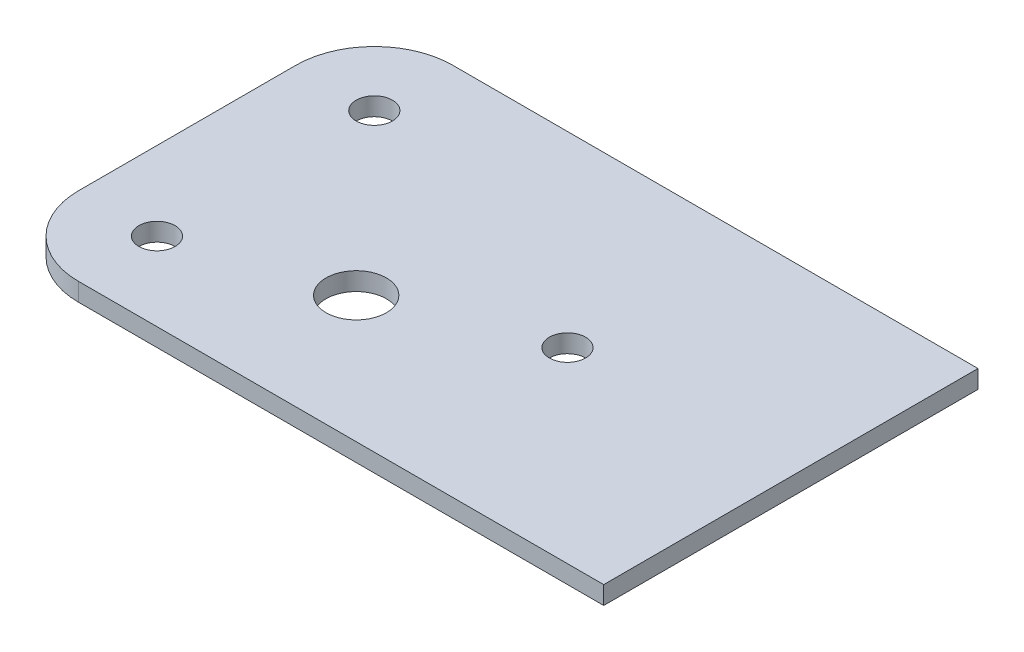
from build123d import *

# Parameters (mm, degrees)
SKETCH1_R      = 3
SKETCH1_R_2    = 5
EXTRUDE1_DEPTH = 3


with BuildPart() as part:
    # Sketch1 → Extrude1 (new body)
    with BuildSketch(Plane(origin=(0, 0, 0), x_dir=(1, 0, 0), z_dir=(0, 1, 0))):
        with BuildLine():
            Line((13, 0), (100, 0))
            Line((100, 0), (100, 62))
            Line((100, 62), (13, 62))
            ThreePointArc((13, 62), (3.807611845, 58.192388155), (0, 49))
            Line((0, 49), (0, 13))
            ThreePointArc((0, 13), (3.807611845, 3.807611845), (13, 0))
        make_face()
        with Locations(Location((13, 49, 0), (0, 0, 270))):
            Circle(SKETCH1_R, mode=Mode.SUBTRACT)
        with Locations(Location((13, 13, 0), (0, 0, 270))):
            Circle(SKETCH1_R, mode=Mode.SUBTRACT)
        with Locations(Location((38, 21, 0), (0, 0, 270))):
            Circle(SKETCH1_R_2, mode=Mode.SUBTRACT)
        with Locations(Location((63, 31, 0), (0, 0, 270))):
            Circle(SKETCH1_R, mode=Mode.SUBTRACT)
    extrude(amount=EXTRUDE1_DEPTH)


solid = part.part
